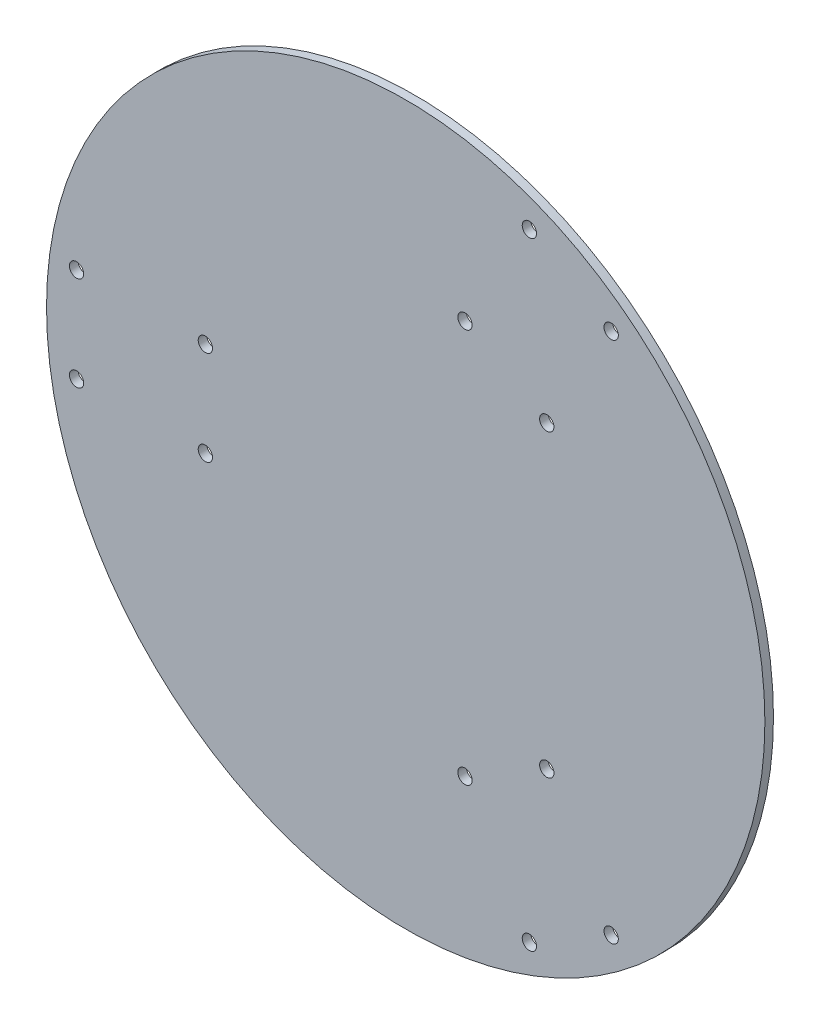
ISO-10303-21;
HEADER;
FILE_DESCRIPTION(('STEP AP214'),'2;1');
FILE_NAME('part.step','',(''),(''),'','','');
FILE_SCHEMA(('AUTOMOTIVE_DESIGN { 1 0 10303 214 1 1 1 1 }'));
ENDSEC;
DATA;
#1=APPLICATION_CONTEXT('core data for automotive mechanical design processes');
#2=APPLICATION_PROTOCOL_DEFINITION('international standard','automotive_design',2000,#1);
#3=PRODUCT_CONTEXT('',#1,'mechanical');
#4=PRODUCT('Part','Part','',(#3));
#5=PRODUCT_RELATED_PRODUCT_CATEGORY('part','',(#4));
#6=PRODUCT_DEFINITION_FORMATION('','',#4);
#7=PRODUCT_DEFINITION_CONTEXT('part definition',#1,'design');
#8=PRODUCT_DEFINITION('design','',#6,#7);
#9=PRODUCT_DEFINITION_SHAPE('','',#8);
#10=(LENGTH_UNIT() NAMED_UNIT(*) SI_UNIT(.MILLI.,.METRE.));
#11=(NAMED_UNIT(*) PLANE_ANGLE_UNIT() SI_UNIT($,.RADIAN.));
#12=(NAMED_UNIT(*) SI_UNIT($,.STERADIAN.) SOLID_ANGLE_UNIT());
#13=UNCERTAINTY_MEASURE_WITH_UNIT(LENGTH_MEASURE(1.E-05),#10,'distance_accuracy_value','');
#14=(GEOMETRIC_REPRESENTATION_CONTEXT(3) GLOBAL_UNCERTAINTY_ASSIGNED_CONTEXT((#13)) GLOBAL_UNIT_ASSIGNED_CONTEXT((#10,
#11,#12)) REPRESENTATION_CONTEXT('',''));
#15=CARTESIAN_POINT('',(0.,0.,0.));
#16=DIRECTION('',(0.,0.,1.));
#17=DIRECTION('',(1.,0.,0.));
#18=AXIS2_PLACEMENT_3D('',#15,#16,#17);
#19=CARTESIAN_POINT('',(0.,0.,0.));
#20=DIRECTION('',(0.,0.,1.));
#21=DIRECTION('',(1.,0.,0.));
#22=AXIS2_PLACEMENT_3D('',#19,#20,#21);
#23=PLANE('',#22);
#24=CARTESIAN_POINT('',(0.,0.,0.));
#25=DIRECTION('',(0.,0.,1.));
#26=DIRECTION('',(1.,0.,0.));
#27=AXIS2_PLACEMENT_3D('',#24,#25,#26);
#28=CIRCLE('',#27,125.5);
#29=CARTESIAN_POINT('',(125.5,0.,0.));
#30=VERTEX_POINT('',#29);
#31=EDGE_CURVE('E47',#30,#30,#28,.T.);
#32=ORIENTED_EDGE('',*,*,#31,.F.);
#33=EDGE_LOOP('',(#32));
#34=FACE_BOUND('',#33,.T.);
#35=CARTESIAN_POINT('',(-70.,-16.5,0.));
#36=DIRECTION('',(0.,0.,-1.));
#37=DIRECTION('',(-1.,0.,0.));
#38=AXIS2_PLACEMENT_3D('',#35,#36,#37);
#39=CIRCLE('',#38,2.5);
#40=CARTESIAN_POINT('',(-72.5,-16.5,0.));
#41=VERTEX_POINT('',#40);
#42=EDGE_CURVE('E125',#41,#41,#39,.T.);
#43=ORIENTED_EDGE('',*,*,#42,.F.);
#44=EDGE_LOOP('',(#43));
#45=FACE_BOUND('',#44,.T.);
#46=CARTESIAN_POINT('',(-70.,16.5,0.));
#47=DIRECTION('',(0.,0.,-1.));
#48=DIRECTION('',(-1.,0.,0.));
#49=AXIS2_PLACEMENT_3D('',#46,#47,#48);
#50=CIRCLE('',#49,2.5);
#51=CARTESIAN_POINT('',(-72.5,16.5,0.));
#52=VERTEX_POINT('',#51);
#53=EDGE_CURVE('E117',#52,#52,#50,.T.);
#54=ORIENTED_EDGE('',*,*,#53,.F.);
#55=EDGE_LOOP('',(#54));
#56=FACE_BOUND('',#55,.T.);
#57=CARTESIAN_POINT('',(-115.,16.5,0.));
#58=DIRECTION('',(0.,0.,-1.));
#59=DIRECTION('',(-1.,0.,0.));
#60=AXIS2_PLACEMENT_3D('',#57,#58,#59);
#61=CIRCLE('',#60,2.5);
#62=CARTESIAN_POINT('',(-117.5,16.5,0.));
#63=VERTEX_POINT('',#62);
#64=EDGE_CURVE('E114',#63,#63,#61,.T.);
#65=ORIENTED_EDGE('',*,*,#64,.F.);
#66=EDGE_LOOP('',(#65));
#67=FACE_BOUND('',#66,.T.);
#68=CARTESIAN_POINT('',(-115.,-16.5,0.));
#69=DIRECTION('',(0.,0.,-1.));
#70=DIRECTION('',(-1.,0.,0.));
#71=AXIS2_PLACEMENT_3D('',#68,#69,#70);
#72=CIRCLE('',#71,2.5);
#73=CARTESIAN_POINT('',(-117.5,-16.5,0.));
#74=VERTEX_POINT('',#73);
#75=EDGE_CURVE('E110',#74,#74,#72,.T.);
#76=ORIENTED_EDGE('',*,*,#75,.F.);
#77=EDGE_LOOP('',(#76));
#78=FACE_BOUND('',#77,.T.);
#79=CARTESIAN_POINT('',(20.7105808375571,68.8717782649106,0.));
#80=DIRECTION('',(0.,0.,-1.));
#81=DIRECTION('',(-1.,0.,0.));
#82=AXIS2_PLACEMENT_3D('',#79,#80,#81);
#83=CIRCLE('',#82,2.5);
#84=CARTESIAN_POINT('',(18.2105808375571,68.8717782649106,0.));
#85=VERTEX_POINT('',#84);
#86=EDGE_CURVE('E65',#85,#85,#83,.T.);
#87=ORIENTED_EDGE('',*,*,#86,.F.);
#88=EDGE_LOOP('',(#87));
#89=FACE_BOUND('',#88,.T.);
#90=CARTESIAN_POINT('',(49.2894191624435,52.3717782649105,0.));
#91=DIRECTION('',(0.,0.,-1.));
#92=DIRECTION('',(-1.,0.,0.));
#93=AXIS2_PLACEMENT_3D('',#90,#91,#92);
#94=CIRCLE('',#93,2.5);
#95=CARTESIAN_POINT('',(46.7894191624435,52.3717782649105,0.));
#96=VERTEX_POINT('',#95);
#97=EDGE_CURVE('E61',#96,#96,#94,.T.);
#98=ORIENTED_EDGE('',*,*,#97,.F.);
#99=EDGE_LOOP('',(#98));
#100=FACE_BOUND('',#99,.T.);
#101=CARTESIAN_POINT('',(71.7894191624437,91.3429214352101,0.));
#102=DIRECTION('',(0.,0.,-1.));
#103=DIRECTION('',(-1.,0.,0.));
#104=AXIS2_PLACEMENT_3D('',#101,#102,#103);
#105=CIRCLE('',#104,2.5);
#106=CARTESIAN_POINT('',(69.2894191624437,91.3429214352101,0.));
#107=VERTEX_POINT('',#106);
#108=EDGE_CURVE('E94',#107,#107,#105,.T.);
#109=ORIENTED_EDGE('',*,*,#108,.F.);
#110=EDGE_LOOP('',(#109));
#111=FACE_BOUND('',#110,.T.);
#112=CARTESIAN_POINT('',(43.2105808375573,107.84292143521,0.));
#113=DIRECTION('',(0.,0.,-1.));
#114=DIRECTION('',(-1.,0.,0.));
#115=AXIS2_PLACEMENT_3D('',#112,#113,#114);
#116=CIRCLE('',#115,2.5);
#117=CARTESIAN_POINT('',(40.7105808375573,107.84292143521,0.));
#118=VERTEX_POINT('',#117);
#119=EDGE_CURVE('E69',#118,#118,#116,.T.);
#120=ORIENTED_EDGE('',*,*,#119,.F.);
#121=EDGE_LOOP('',(#120));
#122=FACE_BOUND('',#121,.T.);
#123=CARTESIAN_POINT('',(49.2894191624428,-52.3717782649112,0.));
#124=DIRECTION('',(0.,0.,-1.));
#125=DIRECTION('',(-1.,0.,0.));
#126=AXIS2_PLACEMENT_3D('',#123,#124,#125);
#127=CIRCLE('',#126,2.5);
#128=CARTESIAN_POINT('',(46.7894191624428,-52.3717782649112,0.));
#129=VERTEX_POINT('',#128);
#130=EDGE_CURVE('E67',#129,#129,#127,.T.);
#131=ORIENTED_EDGE('',*,*,#130,.F.);
#132=EDGE_LOOP('',(#131));
#133=FACE_BOUND('',#132,.T.);
#134=CARTESIAN_POINT('',(20.7105808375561,-68.8717782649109,0.));
#135=DIRECTION('',(0.,0.,-1.));
#136=DIRECTION('',(-1.,0.,0.));
#137=AXIS2_PLACEMENT_3D('',#134,#135,#136);
#138=CIRCLE('',#137,2.5);
#139=CARTESIAN_POINT('',(18.2105808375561,-68.8717782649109,0.));
#140=VERTEX_POINT('',#139);
#141=EDGE_CURVE('E72',#140,#140,#138,.T.);
#142=ORIENTED_EDGE('',*,*,#141,.F.);
#143=EDGE_LOOP('',(#142));
#144=FACE_BOUND('',#143,.T.);
#145=CARTESIAN_POINT('',(43.2105808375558,-107.842921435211,0.));
#146=DIRECTION('',(0.,0.,-1.));
#147=DIRECTION('',(-1.,0.,0.));
#148=AXIS2_PLACEMENT_3D('',#145,#146,#147);
#149=CIRCLE('',#148,2.5);
#150=CARTESIAN_POINT('',(40.7105808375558,-107.842921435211,0.));
#151=VERTEX_POINT('',#150);
#152=EDGE_CURVE('E74',#151,#151,#149,.T.);
#153=ORIENTED_EDGE('',*,*,#152,.F.);
#154=EDGE_LOOP('',(#153));
#155=FACE_BOUND('',#154,.T.);
#156=CARTESIAN_POINT('',(71.7894191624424,-91.3429214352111,0.));
#157=DIRECTION('',(0.,0.,-1.));
#158=DIRECTION('',(-1.,0.,0.));
#159=AXIS2_PLACEMENT_3D('',#156,#157,#158);
#160=CIRCLE('',#159,2.5);
#161=CARTESIAN_POINT('',(69.2894191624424,-91.3429214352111,0.));
#162=VERTEX_POINT('',#161);
#163=EDGE_CURVE('E83',#162,#162,#160,.T.);
#164=ORIENTED_EDGE('',*,*,#163,.F.);
#165=EDGE_LOOP('',(#164));
#166=FACE_BOUND('',#165,.T.);
#167=ADVANCED_FACE('F41',(#34,#45,#56,#67,#78,#89,#100,#111,#122,#133,#144,#155,#166),#23,.F.);
#168=CARTESIAN_POINT('',(0.,0.,3.));
#169=DIRECTION('',(0.,0.,-1.));
#170=DIRECTION('',(-1.,0.,0.));
#171=AXIS2_PLACEMENT_3D('',#168,#169,#170);
#172=CYLINDRICAL_SURFACE('',#171,125.5);
#173=CARTESIAN_POINT('',(0.,0.,3.));
#174=DIRECTION('',(0.,0.,1.));
#175=DIRECTION('',(1.,0.,0.));
#176=AXIS2_PLACEMENT_3D('',#173,#174,#175);
#177=CIRCLE('',#176,125.5);
#178=CARTESIAN_POINT('',(125.5,0.,3.));
#179=VERTEX_POINT('',#178);
#180=EDGE_CURVE('E10',#179,#179,#177,.T.);
#181=ORIENTED_EDGE('',*,*,#180,.F.);
#182=EDGE_LOOP('',(#181));
#183=FACE_BOUND('',#182,.T.);
#184=ORIENTED_EDGE('',*,*,#31,.T.);
#185=EDGE_LOOP('',(#184));
#186=FACE_BOUND('',#185,.T.);
#187=ADVANCED_FACE('F43',(#183,#186),#172,.T.);
#188=CARTESIAN_POINT('',(0.,0.,3.));
#189=DIRECTION('',(0.,0.,1.));
#190=DIRECTION('',(1.,0.,0.));
#191=AXIS2_PLACEMENT_3D('',#188,#189,#190);
#192=PLANE('',#191);
#193=CARTESIAN_POINT('',(71.7894191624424,-91.3429214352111,3.));
#194=DIRECTION('',(0.,0.,1.));
#195=DIRECTION('',(1.,0.,0.));
#196=AXIS2_PLACEMENT_3D('',#193,#194,#195);
#197=CIRCLE('',#196,2.5);
#198=CARTESIAN_POINT('',(74.2894191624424,-91.3429214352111,3.));
#199=VERTEX_POINT('',#198);
#200=EDGE_CURVE('E44',#199,#199,#197,.T.);
#201=ORIENTED_EDGE('',*,*,#200,.F.);
#202=EDGE_LOOP('',(#201));
#203=FACE_BOUND('',#202,.T.);
#204=CARTESIAN_POINT('',(43.2105808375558,-107.842921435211,3.));
#205=DIRECTION('',(0.,0.,1.));
#206=DIRECTION('',(1.,0.,0.));
#207=AXIS2_PLACEMENT_3D('',#204,#205,#206);
#208=CIRCLE('',#207,2.5);
#209=CARTESIAN_POINT('',(45.7105808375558,-107.842921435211,3.));
#210=VERTEX_POINT('',#209);
#211=EDGE_CURVE('E75',#210,#210,#208,.T.);
#212=ORIENTED_EDGE('',*,*,#211,.F.);
#213=EDGE_LOOP('',(#212));
#214=FACE_BOUND('',#213,.T.);
#215=CARTESIAN_POINT('',(20.7105808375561,-68.8717782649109,3.));
#216=DIRECTION('',(0.,0.,1.));
#217=DIRECTION('',(1.,0.,0.));
#218=AXIS2_PLACEMENT_3D('',#215,#216,#217);
#219=CIRCLE('',#218,2.5);
#220=CARTESIAN_POINT('',(23.2105808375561,-68.8717782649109,3.));
#221=VERTEX_POINT('',#220);
#222=EDGE_CURVE('E70',#221,#221,#219,.T.);
#223=ORIENTED_EDGE('',*,*,#222,.F.);
#224=EDGE_LOOP('',(#223));
#225=FACE_BOUND('',#224,.T.);
#226=CARTESIAN_POINT('',(49.2894191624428,-52.3717782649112,3.));
#227=DIRECTION('',(0.,0.,1.));
#228=DIRECTION('',(1.,0.,0.));
#229=AXIS2_PLACEMENT_3D('',#226,#227,#228);
#230=CIRCLE('',#229,2.5);
#231=CARTESIAN_POINT('',(51.7894191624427,-52.3717782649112,3.));
#232=VERTEX_POINT('',#231);
#233=EDGE_CURVE('E62',#232,#232,#230,.T.);
#234=ORIENTED_EDGE('',*,*,#233,.F.);
#235=EDGE_LOOP('',(#234));
#236=FACE_BOUND('',#235,.T.);
#237=CARTESIAN_POINT('',(43.2105808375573,107.84292143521,3.));
#238=DIRECTION('',(0.,0.,1.));
#239=DIRECTION('',(1.,0.,0.));
#240=AXIS2_PLACEMENT_3D('',#237,#238,#239);
#241=CIRCLE('',#240,2.5);
#242=CARTESIAN_POINT('',(45.7105808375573,107.84292143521,3.));
#243=VERTEX_POINT('',#242);
#244=EDGE_CURVE('E93',#243,#243,#241,.T.);
#245=ORIENTED_EDGE('',*,*,#244,.F.);
#246=EDGE_LOOP('',(#245));
#247=FACE_BOUND('',#246,.T.);
#248=CARTESIAN_POINT('',(71.7894191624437,91.3429214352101,3.));
#249=DIRECTION('',(0.,0.,1.));
#250=DIRECTION('',(1.,0.,0.));
#251=AXIS2_PLACEMENT_3D('',#248,#249,#250);
#252=CIRCLE('',#251,2.5);
#253=CARTESIAN_POINT('',(74.2894191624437,91.3429214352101,3.));
#254=VERTEX_POINT('',#253);
#255=EDGE_CURVE('E100',#254,#254,#252,.T.);
#256=ORIENTED_EDGE('',*,*,#255,.F.);
#257=EDGE_LOOP('',(#256));
#258=FACE_BOUND('',#257,.T.);
#259=CARTESIAN_POINT('',(49.2894191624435,52.3717782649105,3.));
#260=DIRECTION('',(0.,0.,1.));
#261=DIRECTION('',(1.,0.,0.));
#262=AXIS2_PLACEMENT_3D('',#259,#260,#261);
#263=CIRCLE('',#262,2.5);
#264=CARTESIAN_POINT('',(51.7894191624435,52.3717782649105,3.));
#265=VERTEX_POINT('',#264);
#266=EDGE_CURVE('E56',#265,#265,#263,.T.);
#267=ORIENTED_EDGE('',*,*,#266,.F.);
#268=EDGE_LOOP('',(#267));
#269=FACE_BOUND('',#268,.T.);
#270=CARTESIAN_POINT('',(20.7105808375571,68.8717782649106,3.));
#271=DIRECTION('',(0.,0.,1.));
#272=DIRECTION('',(1.,0.,0.));
#273=AXIS2_PLACEMENT_3D('',#270,#271,#272);
#274=CIRCLE('',#273,2.5);
#275=CARTESIAN_POINT('',(23.2105808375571,68.8717782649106,3.));
#276=VERTEX_POINT('',#275);
#277=EDGE_CURVE('E102',#276,#276,#274,.T.);
#278=ORIENTED_EDGE('',*,*,#277,.F.);
#279=EDGE_LOOP('',(#278));
#280=FACE_BOUND('',#279,.T.);
#281=CARTESIAN_POINT('',(-115.,-16.5,3.));
#282=DIRECTION('',(0.,0.,1.));
#283=DIRECTION('',(1.,0.,0.));
#284=AXIS2_PLACEMENT_3D('',#281,#282,#283);
#285=CIRCLE('',#284,2.5);
#286=CARTESIAN_POINT('',(-112.5,-16.5,3.));
#287=VERTEX_POINT('',#286);
#288=EDGE_CURVE('E109',#287,#287,#285,.T.);
#289=ORIENTED_EDGE('',*,*,#288,.F.);
#290=EDGE_LOOP('',(#289));
#291=FACE_BOUND('',#290,.T.);
#292=CARTESIAN_POINT('',(-115.,16.5,3.));
#293=DIRECTION('',(0.,0.,1.));
#294=DIRECTION('',(1.,0.,0.));
#295=AXIS2_PLACEMENT_3D('',#292,#293,#294);
#296=CIRCLE('',#295,2.5);
#297=CARTESIAN_POINT('',(-112.5,16.5,3.));
#298=VERTEX_POINT('',#297);
#299=EDGE_CURVE('E118',#298,#298,#296,.T.);
#300=ORIENTED_EDGE('',*,*,#299,.F.);
#301=EDGE_LOOP('',(#300));
#302=FACE_BOUND('',#301,.T.);
#303=CARTESIAN_POINT('',(-70.,16.5,3.));
#304=DIRECTION('',(0.,0.,1.));
#305=DIRECTION('',(1.,0.,0.));
#306=AXIS2_PLACEMENT_3D('',#303,#304,#305);
#307=CIRCLE('',#306,2.5);
#308=CARTESIAN_POINT('',(-67.5,16.5,3.));
#309=VERTEX_POINT('',#308);
#310=EDGE_CURVE('E124',#309,#309,#307,.T.);
#311=ORIENTED_EDGE('',*,*,#310,.F.);
#312=EDGE_LOOP('',(#311));
#313=FACE_BOUND('',#312,.T.);
#314=CARTESIAN_POINT('',(-70.,-16.5,3.));
#315=DIRECTION('',(0.,0.,1.));
#316=DIRECTION('',(1.,0.,0.));
#317=AXIS2_PLACEMENT_3D('',#314,#315,#316);
#318=CIRCLE('',#317,2.5);
#319=CARTESIAN_POINT('',(-67.5,-16.5,3.));
#320=VERTEX_POINT('',#319);
#321=EDGE_CURVE('E53',#320,#320,#318,.T.);
#322=ORIENTED_EDGE('',*,*,#321,.F.);
#323=EDGE_LOOP('',(#322));
#324=FACE_BOUND('',#323,.T.);
#325=ORIENTED_EDGE('',*,*,#180,.T.);
#326=EDGE_LOOP('',(#325));
#327=FACE_BOUND('',#326,.T.);
#328=ADVANCED_FACE('F135',(#203,#214,#225,#236,#247,#258,#269,#280,#291,#302,#313,#324,#327),
#192,.T.);
#329=CARTESIAN_POINT('',(-70.,-16.5,0.));
#330=DIRECTION('',(0.,0.,-1.));
#331=DIRECTION('',(-1.,0.,0.));
#332=AXIS2_PLACEMENT_3D('',#329,#330,#331);
#333=CYLINDRICAL_SURFACE('',#332,2.5);
#334=ORIENTED_EDGE('',*,*,#321,.T.);
#335=EDGE_LOOP('',(#334));
#336=FACE_BOUND('',#335,.T.);
#337=ORIENTED_EDGE('',*,*,#42,.T.);
#338=EDGE_LOOP('',(#337));
#339=FACE_BOUND('',#338,.T.);
#340=ADVANCED_FACE('F132',(#336,#339),#333,.F.);
#341=CARTESIAN_POINT('',(-70.,16.5,0.));
#342=DIRECTION('',(0.,0.,-1.));
#343=DIRECTION('',(-1.,0.,0.));
#344=AXIS2_PLACEMENT_3D('',#341,#342,#343);
#345=CYLINDRICAL_SURFACE('',#344,2.5);
#346=ORIENTED_EDGE('',*,*,#310,.T.);
#347=EDGE_LOOP('',(#346));
#348=FACE_BOUND('',#347,.T.);
#349=ORIENTED_EDGE('',*,*,#53,.T.);
#350=EDGE_LOOP('',(#349));
#351=FACE_BOUND('',#350,.T.);
#352=ADVANCED_FACE('F142',(#348,#351),#345,.F.);
#353=CARTESIAN_POINT('',(-115.,16.5,0.));
#354=DIRECTION('',(0.,0.,-1.));
#355=DIRECTION('',(-1.,0.,0.));
#356=AXIS2_PLACEMENT_3D('',#353,#354,#355);
#357=CYLINDRICAL_SURFACE('',#356,2.5);
#358=ORIENTED_EDGE('',*,*,#299,.T.);
#359=EDGE_LOOP('',(#358));
#360=FACE_BOUND('',#359,.T.);
#361=ORIENTED_EDGE('',*,*,#64,.T.);
#362=EDGE_LOOP('',(#361));
#363=FACE_BOUND('',#362,.T.);
#364=ADVANCED_FACE('F215',(#360,#363),#357,.F.);
#365=CARTESIAN_POINT('',(-115.,-16.5,0.));
#366=DIRECTION('',(0.,0.,-1.));
#367=DIRECTION('',(-1.,0.,0.));
#368=AXIS2_PLACEMENT_3D('',#365,#366,#367);
#369=CYLINDRICAL_SURFACE('',#368,2.5);
#370=ORIENTED_EDGE('',*,*,#288,.T.);
#371=EDGE_LOOP('',(#370));
#372=FACE_BOUND('',#371,.T.);
#373=ORIENTED_EDGE('',*,*,#75,.T.);
#374=EDGE_LOOP('',(#373));
#375=FACE_BOUND('',#374,.T.);
#376=ADVANCED_FACE('F207',(#372,#375),#369,.F.);
#377=CARTESIAN_POINT('',(20.7105808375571,68.8717782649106,0.));
#378=DIRECTION('',(0.,0.,-1.));
#379=DIRECTION('',(-1.,0.,0.));
#380=AXIS2_PLACEMENT_3D('',#377,#378,#379);
#381=CYLINDRICAL_SURFACE('',#380,2.5);
#382=ORIENTED_EDGE('',*,*,#277,.T.);
#383=EDGE_LOOP('',(#382));
#384=FACE_BOUND('',#383,.T.);
#385=ORIENTED_EDGE('',*,*,#86,.T.);
#386=EDGE_LOOP('',(#385));
#387=FACE_BOUND('',#386,.T.);
#388=ADVANCED_FACE('F206',(#384,#387),#381,.F.);
#389=CARTESIAN_POINT('',(49.2894191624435,52.3717782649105,0.));
#390=DIRECTION('',(0.,0.,-1.));
#391=DIRECTION('',(-1.,0.,0.));
#392=AXIS2_PLACEMENT_3D('',#389,#390,#391);
#393=CYLINDRICAL_SURFACE('',#392,2.5);
#394=ORIENTED_EDGE('',*,*,#266,.T.);
#395=EDGE_LOOP('',(#394));
#396=FACE_BOUND('',#395,.T.);
#397=ORIENTED_EDGE('',*,*,#97,.T.);
#398=EDGE_LOOP('',(#397));
#399=FACE_BOUND('',#398,.T.);
#400=ADVANCED_FACE('F205',(#396,#399),#393,.F.);
#401=CARTESIAN_POINT('',(71.7894191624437,91.3429214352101,0.));
#402=DIRECTION('',(0.,0.,-1.));
#403=DIRECTION('',(-1.,0.,0.));
#404=AXIS2_PLACEMENT_3D('',#401,#402,#403);
#405=CYLINDRICAL_SURFACE('',#404,2.5);
#406=ORIENTED_EDGE('',*,*,#255,.T.);
#407=EDGE_LOOP('',(#406));
#408=FACE_BOUND('',#407,.T.);
#409=ORIENTED_EDGE('',*,*,#108,.T.);
#410=EDGE_LOOP('',(#409));
#411=FACE_BOUND('',#410,.T.);
#412=ADVANCED_FACE('F196',(#408,#411),#405,.F.);
#413=CARTESIAN_POINT('',(43.2105808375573,107.84292143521,0.));
#414=DIRECTION('',(0.,0.,-1.));
#415=DIRECTION('',(-1.,0.,0.));
#416=AXIS2_PLACEMENT_3D('',#413,#414,#415);
#417=CYLINDRICAL_SURFACE('',#416,2.5);
#418=ORIENTED_EDGE('',*,*,#244,.T.);
#419=EDGE_LOOP('',(#418));
#420=FACE_BOUND('',#419,.T.);
#421=ORIENTED_EDGE('',*,*,#119,.T.);
#422=EDGE_LOOP('',(#421));
#423=FACE_BOUND('',#422,.T.);
#424=ADVANCED_FACE('F193',(#420,#423),#417,.F.);
#425=CARTESIAN_POINT('',(49.2894191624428,-52.3717782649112,0.));
#426=DIRECTION('',(0.,0.,-1.));
#427=DIRECTION('',(-1.,0.,0.));
#428=AXIS2_PLACEMENT_3D('',#425,#426,#427);
#429=CYLINDRICAL_SURFACE('',#428,2.5);
#430=ORIENTED_EDGE('',*,*,#233,.T.);
#431=EDGE_LOOP('',(#430));
#432=FACE_BOUND('',#431,.T.);
#433=ORIENTED_EDGE('',*,*,#130,.T.);
#434=EDGE_LOOP('',(#433));
#435=FACE_BOUND('',#434,.T.);
#436=ADVANCED_FACE('F188',(#432,#435),#429,.F.);
#437=CARTESIAN_POINT('',(20.7105808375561,-68.8717782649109,0.));
#438=DIRECTION('',(0.,0.,-1.));
#439=DIRECTION('',(-1.,0.,0.));
#440=AXIS2_PLACEMENT_3D('',#437,#438,#439);
#441=CYLINDRICAL_SURFACE('',#440,2.5);
#442=ORIENTED_EDGE('',*,*,#222,.T.);
#443=EDGE_LOOP('',(#442));
#444=FACE_BOUND('',#443,.T.);
#445=ORIENTED_EDGE('',*,*,#141,.T.);
#446=EDGE_LOOP('',(#445));
#447=FACE_BOUND('',#446,.T.);
#448=ADVANCED_FACE('F183',(#444,#447),#441,.F.);
#449=CARTESIAN_POINT('',(43.2105808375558,-107.842921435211,0.));
#450=DIRECTION('',(0.,0.,-1.));
#451=DIRECTION('',(-1.,0.,0.));
#452=AXIS2_PLACEMENT_3D('',#449,#450,#451);
#453=CYLINDRICAL_SURFACE('',#452,2.5);
#454=ORIENTED_EDGE('',*,*,#211,.T.);
#455=EDGE_LOOP('',(#454));
#456=FACE_BOUND('',#455,.T.);
#457=ORIENTED_EDGE('',*,*,#152,.T.);
#458=EDGE_LOOP('',(#457));
#459=FACE_BOUND('',#458,.T.);
#460=ADVANCED_FACE('F180',(#456,#459),#453,.F.);
#461=CARTESIAN_POINT('',(71.7894191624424,-91.3429214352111,0.));
#462=DIRECTION('',(0.,0.,-1.));
#463=DIRECTION('',(-1.,0.,0.));
#464=AXIS2_PLACEMENT_3D('',#461,#462,#463);
#465=CYLINDRICAL_SURFACE('',#464,2.5);
#466=ORIENTED_EDGE('',*,*,#200,.T.);
#467=EDGE_LOOP('',(#466));
#468=FACE_BOUND('',#467,.T.);
#469=ORIENTED_EDGE('',*,*,#163,.T.);
#470=EDGE_LOOP('',(#469));
#471=FACE_BOUND('',#470,.T.);
#472=ADVANCED_FACE('F179',(#468,#471),#465,.F.);
#473=CLOSED_SHELL('',(#167,#187,#328,#340,#352,#364,#376,#388,#400,#412,#424,#436,#448,#460,#472));
#474=MANIFOLD_SOLID_BREP('B2',#473);
#475=ADVANCED_BREP_SHAPE_REPRESENTATION('',(#18,#474),#14);
#476=SHAPE_DEFINITION_REPRESENTATION(#9,#475);
ENDSEC;
END-ISO-10303-21;
